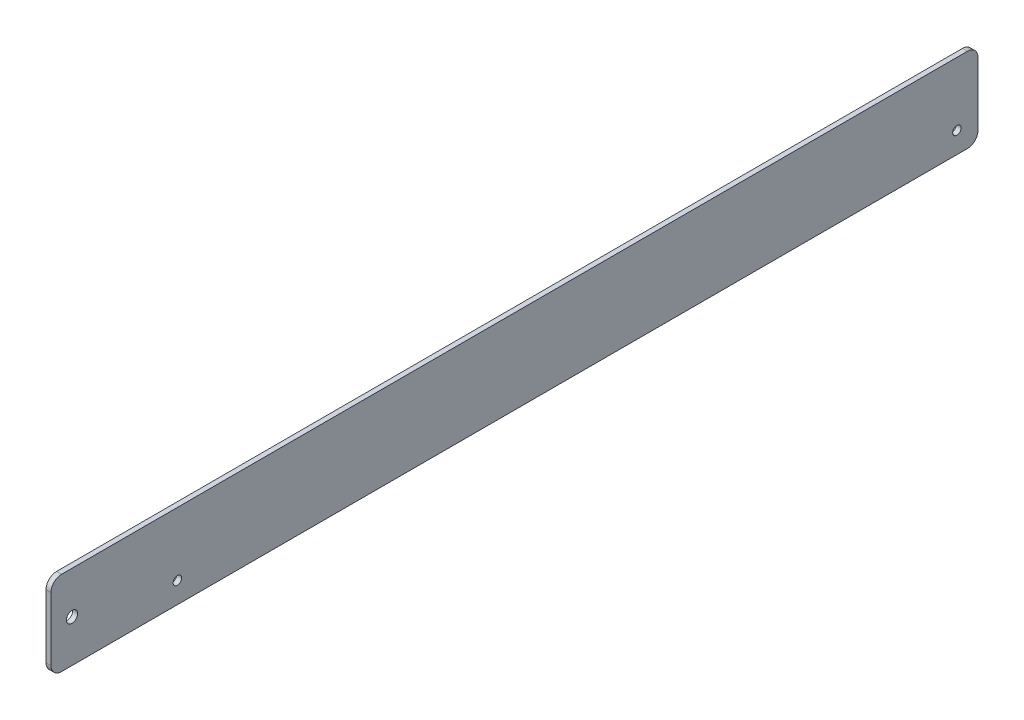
from build123d import *

# Parameters (mm, degrees)
SKETCH1_W                        = 558.8
SKETCH1_H                        = 50.8
BOSS_EXTRUDE1_DEPTH              = 2.9972
F_7_0_201_DIAMETER_HOLE1_D       = 5.1054
F_17_64_0_26563_DIAMETER_HOLE1_D = 6.747002
FILLET1_R                        = 6.35


with BuildPart() as part:
    # Sketch1 → Boss-Extrude1 (new body)
    with BuildSketch(Plane(origin=(0, 0, 0), x_dir=(0, 0, -1), z_dir=(1, 0, 0))):
        Rectangle(SKETCH1_W, SKETCH1_H)
    extrude(amount=BOSS_EXTRUDE1_DEPTH)

    # 7 _0.201_ Diameter Hole1 (through all)
    with Locations(Plane(origin=(2.9972, 0, 0), x_dir=(0, 0, -1), z_dir=(1, 0, 0))):
        with Locations((-203.2, -12.7), (266.7, -12.7)):
            Hole(F_7_0_201_DIAMETER_HOLE1_D / 2)

    # 17_64 _0.26563_ Diameter Hole1 (through all)
    with Locations(Plane(origin=(2.9972, 0, 0), x_dir=(0, 0, -1), z_dir=(1, 0, 0))):
        with Locations((-266.7, 0)):
            Hole(F_17_64_0_26563_DIAMETER_HOLE1_D / 2)

    # Fillet1
    fillet1_edges = [part.edges().sort_by_distance(p)[0] for p in [
        (1.4986, -25.4, -279.4),
        (1.4986, -25.4, 279.4),
        (1.4986, 25.4, 279.4),
        (1.4986, 25.4, -279.4),
    ]]
    fillet(fillet1_edges, radius=FILLET1_R)


solid = part.part
